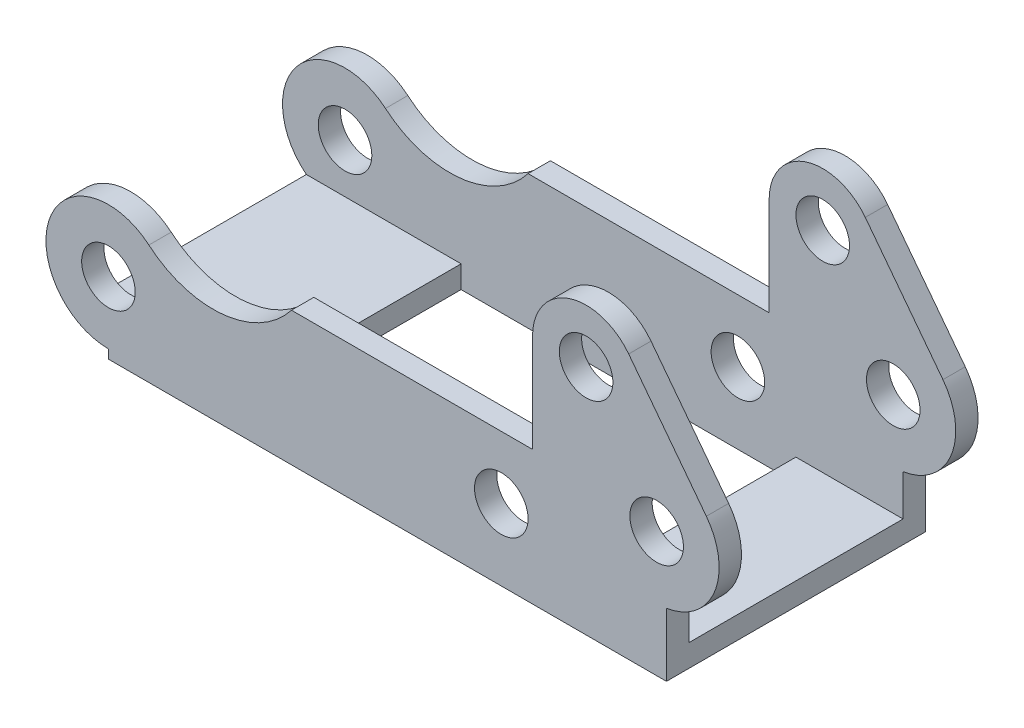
ISO-10303-21;
HEADER;
FILE_DESCRIPTION(('STEP AP214'),'2;1');
FILE_NAME('part.step','',(''),(''),'','','');
FILE_SCHEMA(('AUTOMOTIVE_DESIGN { 1 0 10303 214 1 1 1 1 }'));
ENDSEC;
DATA;
#1=APPLICATION_CONTEXT('core data for automotive mechanical design processes');
#2=APPLICATION_PROTOCOL_DEFINITION('international standard','automotive_design',2000,#1);
#3=PRODUCT_CONTEXT('',#1,'mechanical');
#4=PRODUCT('Part','Part','',(#3));
#5=PRODUCT_RELATED_PRODUCT_CATEGORY('part','',(#4));
#6=PRODUCT_DEFINITION_FORMATION('','',#4);
#7=PRODUCT_DEFINITION_CONTEXT('part definition',#1,'design');
#8=PRODUCT_DEFINITION('design','',#6,#7);
#9=PRODUCT_DEFINITION_SHAPE('','',#8);
#10=(LENGTH_UNIT() NAMED_UNIT(*) SI_UNIT(.MILLI.,.METRE.));
#11=(NAMED_UNIT(*) PLANE_ANGLE_UNIT() SI_UNIT($,.RADIAN.));
#12=(NAMED_UNIT(*) SI_UNIT($,.STERADIAN.) SOLID_ANGLE_UNIT());
#13=UNCERTAINTY_MEASURE_WITH_UNIT(LENGTH_MEASURE(1.E-05),#10,'distance_accuracy_value','');
#14=(GEOMETRIC_REPRESENTATION_CONTEXT(3) GLOBAL_UNCERTAINTY_ASSIGNED_CONTEXT((#13)) GLOBAL_UNIT_ASSIGNED_CONTEXT((#10,
#11,#12)) REPRESENTATION_CONTEXT('',''));
#15=CARTESIAN_POINT('',(0.,0.,0.));
#16=DIRECTION('',(0.,0.,1.));
#17=DIRECTION('',(1.,0.,0.));
#18=AXIS2_PLACEMENT_3D('',#15,#16,#17);
#19=CARTESIAN_POINT('',(5.85949051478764,6.90531946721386,0.));
#20=DIRECTION('',(0.,0.,1.));
#21=DIRECTION('',(1.,0.,0.));
#22=AXIS2_PLACEMENT_3D('',#19,#20,#21);
#23=CYLINDRICAL_SURFACE('',#22,5.55632740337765);
#24=DIRECTION('',(0.,0.,1.));
#25=VECTOR('',#24,1.);
#26=CARTESIAN_POINT('',(10.25,3.5,0.));
#27=LINE('',#26,#25);
#28=CARTESIAN_POINT('',(10.25,3.50000000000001,0.));
#29=VERTEX_POINT('',#28);
#30=CARTESIAN_POINT('',(10.25,3.5,1.25));
#31=VERTEX_POINT('',#30);
#32=EDGE_CURVE('E250',#29,#31,#27,.T.);
#33=ORIENTED_EDGE('',*,*,#32,.F.);
#34=CARTESIAN_POINT('',(5.85949051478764,6.90531946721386,0.));
#35=DIRECTION('',(0.,0.,1.));
#36=DIRECTION('',(1.,0.,0.));
#37=AXIS2_PLACEMENT_3D('',#34,#35,#36);
#38=CIRCLE('',#37,5.55632740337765);
#39=CARTESIAN_POINT('',(2.26451804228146,2.66869969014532,0.));
#40=VERTEX_POINT('',#39);
#41=EDGE_CURVE('E348',#29,#40,#38,.F.);
#42=ORIENTED_EDGE('',*,*,#41,.T.);
#43=DIRECTION('',(0.,0.,1.));
#44=VECTOR('',#43,1.);
#45=CARTESIAN_POINT('',(2.26451804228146,2.66869969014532,0.));
#46=LINE('',#45,#44);
#47=CARTESIAN_POINT('',(2.26451804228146,2.66869969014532,1.25));
#48=VERTEX_POINT('',#47);
#49=EDGE_CURVE('E253',#48,#40,#46,.F.);
#50=ORIENTED_EDGE('',*,*,#49,.F.);
#51=CARTESIAN_POINT('',(5.85949051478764,6.90531946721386,1.25));
#52=DIRECTION('',(0.,0.,1.));
#53=DIRECTION('',(1.,0.,0.));
#54=AXIS2_PLACEMENT_3D('',#51,#52,#53);
#55=CIRCLE('',#54,5.55632740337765);
#56=EDGE_CURVE('E334',#48,#31,#55,.T.);
#57=ORIENTED_EDGE('',*,*,#56,.T.);
#58=EDGE_LOOP('',(#33,#42,#50,#57));
#59=FACE_BOUND('',#58,.T.);
#60=ADVANCED_FACE('F15',(#59),#23,.F.);
#61=CARTESIAN_POINT('',(10.25,3.5,0.));
#62=DIRECTION('',(0.,1.,0.));
#63=DIRECTION('',(0.,0.,1.));
#64=AXIS2_PLACEMENT_3D('',#61,#62,#63);
#65=PLANE('',#64);
#66=DIRECTION('',(1.,0.,0.));
#67=VECTOR('',#66,1.);
#68=CARTESIAN_POINT('',(16.8167036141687,3.50000000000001,0.));
#69=LINE('',#68,#67);
#70=CARTESIAN_POINT('',(23.75,3.50000000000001,0.));
#71=VERTEX_POINT('',#70);
#72=EDGE_CURVE('E350',#71,#29,#69,.F.);
#73=ORIENTED_EDGE('',*,*,#72,.T.);
#74=ORIENTED_EDGE('',*,*,#32,.T.);
#75=DIRECTION('',(-1.,0.,0.));
#76=VECTOR('',#75,1.);
#77=CARTESIAN_POINT('',(-11.2965105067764,3.5,1.25));
#78=LINE('',#77,#76);
#79=CARTESIAN_POINT('',(23.75,3.5,1.25));
#80=VERTEX_POINT('',#79);
#81=EDGE_CURVE('E336',#31,#80,#78,.F.);
#82=ORIENTED_EDGE('',*,*,#81,.T.);
#83=DIRECTION('',(0.,0.,1.));
#84=VECTOR('',#83,1.);
#85=CARTESIAN_POINT('',(23.75,3.50000000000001,0.));
#86=LINE('',#85,#84);
#87=EDGE_CURVE('E247',#71,#80,#86,.T.);
#88=ORIENTED_EDGE('',*,*,#87,.F.);
#89=EDGE_LOOP('',(#73,#74,#82,#88));
#90=FACE_BOUND('',#89,.T.);
#91=ADVANCED_FACE('F515',(#90),#65,.T.);
#92=CARTESIAN_POINT('',(23.75,3.50000000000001,0.));
#93=DIRECTION('',(-1.,0.,0.));
#94=DIRECTION('',(0.,0.,1.));
#95=AXIS2_PLACEMENT_3D('',#92,#93,#94);
#96=PLANE('',#95);
#97=DIRECTION('',(0.,1.,0.));
#98=VECTOR('',#97,1.);
#99=CARTESIAN_POINT('',(23.75,1.27597686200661,0.));
#100=LINE('',#99,#98);
#101=CARTESIAN_POINT('',(23.75,9.,0.));
#102=VERTEX_POINT('',#101);
#103=EDGE_CURVE('E353',#102,#71,#100,.F.);
#104=ORIENTED_EDGE('',*,*,#103,.T.);
#105=ORIENTED_EDGE('',*,*,#87,.T.);
#106=DIRECTION('',(0.,1.,0.));
#107=VECTOR('',#106,1.);
#108=CARTESIAN_POINT('',(23.75,-2.75,1.25));
#109=LINE('',#108,#107);
#110=CARTESIAN_POINT('',(23.75,9.,1.25));
#111=VERTEX_POINT('',#110);
#112=EDGE_CURVE('E333',#80,#111,#109,.T.);
#113=ORIENTED_EDGE('',*,*,#112,.T.);
#114=DIRECTION('',(0.,0.,1.));
#115=VECTOR('',#114,1.);
#116=CARTESIAN_POINT('',(23.75,9.,0.));
#117=LINE('',#116,#115);
#118=EDGE_CURVE('E244',#102,#111,#117,.T.);
#119=ORIENTED_EDGE('',*,*,#118,.F.);
#120=EDGE_LOOP('',(#104,#105,#113,#119));
#121=FACE_BOUND('',#120,.T.);
#122=ADVANCED_FACE('F519',(#121),#96,.T.);
#123=CARTESIAN_POINT('',(26.75,9.,0.));
#124=DIRECTION('',(0.,0.,1.));
#125=DIRECTION('',(1.,0.,0.));
#126=AXIS2_PLACEMENT_3D('',#123,#124,#125);
#127=CYLINDRICAL_SURFACE('',#126,3.);
#128=CARTESIAN_POINT('',(26.75,9.,0.));
#129=DIRECTION('',(0.,0.,1.));
#130=DIRECTION('',(1.,0.,0.));
#131=AXIS2_PLACEMENT_3D('',#128,#129,#130);
#132=CIRCLE('',#131,3.);
#133=CARTESIAN_POINT('',(29.1348492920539,10.8200257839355,0.));
#134=VERTEX_POINT('',#133);
#135=EDGE_CURVE('E351',#134,#102,#132,.T.);
#136=ORIENTED_EDGE('',*,*,#135,.T.);
#137=ORIENTED_EDGE('',*,*,#118,.T.);
#138=CARTESIAN_POINT('',(26.75,9.,1.25));
#139=DIRECTION('',(0.,0.,1.));
#140=DIRECTION('',(1.,0.,0.));
#141=AXIS2_PLACEMENT_3D('',#138,#139,#140);
#142=CIRCLE('',#141,3.);
#143=CARTESIAN_POINT('',(29.1348492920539,10.8200257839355,1.25));
#144=VERTEX_POINT('',#143);
#145=EDGE_CURVE('E331',#111,#144,#142,.F.);
#146=ORIENTED_EDGE('',*,*,#145,.T.);
#147=DIRECTION('',(0.,0.,1.));
#148=VECTOR('',#147,1.);
#149=CARTESIAN_POINT('',(29.1348492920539,10.8200257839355,0.));
#150=LINE('',#149,#148);
#151=EDGE_CURVE('E179',#134,#144,#150,.T.);
#152=ORIENTED_EDGE('',*,*,#151,.F.);
#153=EDGE_LOOP('',(#136,#137,#146,#152));
#154=FACE_BOUND('',#153,.T.);
#155=ADVANCED_FACE('F521',(#154),#127,.T.);
#156=CARTESIAN_POINT('',(29.1348492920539,10.8200257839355,0.));
#157=DIRECTION('',(0.794949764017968,0.60667526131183,0.));
#158=DIRECTION('',(-0.60667526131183,0.794949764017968,0.));
#159=AXIS2_PLACEMENT_3D('',#156,#157,#158);
#160=PLANE('',#159);
#161=DIRECTION('',(-0.60667526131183,0.794949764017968,0.));
#162=VECTOR('',#161,1.);
#163=CARTESIAN_POINT('',(33.4823241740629,5.12336341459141,0.));
#164=LINE('',#163,#162);
#165=CARTESIAN_POINT('',(33.4823241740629,5.12336341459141,0.));
#166=VERTEX_POINT('',#165);
#167=EDGE_CURVE('E190',#166,#134,#164,.T.);
#168=ORIENTED_EDGE('',*,*,#167,.T.);
#169=ORIENTED_EDGE('',*,*,#151,.T.);
#170=DIRECTION('',(0.60667526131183,-0.794949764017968,0.));
#171=VECTOR('',#170,1.);
#172=CARTESIAN_POINT('',(29.1348492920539,10.8200257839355,1.25));
#173=LINE('',#172,#171);
#174=CARTESIAN_POINT('',(33.4823241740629,5.1233634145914,1.25));
#175=VERTEX_POINT('',#174);
#176=EDGE_CURVE('E330',#144,#175,#173,.T.);
#177=ORIENTED_EDGE('',*,*,#176,.T.);
#178=DIRECTION('',(0.,0.,1.));
#179=VECTOR('',#178,1.);
#180=CARTESIAN_POINT('',(33.4823241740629,5.1233634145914,0.));
#181=LINE('',#180,#179);
#182=EDGE_CURVE('E178',#166,#175,#181,.T.);
#183=ORIENTED_EDGE('',*,*,#182,.F.);
#184=EDGE_LOOP('',(#168,#169,#177,#183));
#185=FACE_BOUND('',#184,.T.);
#186=ADVANCED_FACE('F523',(#185),#160,.T.);
#187=CARTESIAN_POINT('',(30.7,3.,0.));
#188=DIRECTION('',(0.,0.,1.));
#189=DIRECTION('',(1.,0.,0.));
#190=AXIS2_PLACEMENT_3D('',#187,#188,#189);
#191=CYLINDRICAL_SURFACE('',#190,3.5);
#192=CARTESIAN_POINT('',(30.7,3.,0.));
#193=DIRECTION('',(0.,0.,1.));
#194=DIRECTION('',(1.,0.,0.));
#195=AXIS2_PLACEMENT_3D('',#192,#193,#194);
#196=CIRCLE('',#195,3.5);
#197=CARTESIAN_POINT('',(31.25,-0.456515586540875,0.));
#198=VERTEX_POINT('',#197);
#199=EDGE_CURVE('E18',#198,#166,#196,.T.);
#200=ORIENTED_EDGE('',*,*,#199,.T.);
#201=ORIENTED_EDGE('',*,*,#182,.T.);
#202=CARTESIAN_POINT('',(30.7,3.,1.25));
#203=DIRECTION('',(0.,0.,1.));
#204=DIRECTION('',(1.,0.,0.));
#205=AXIS2_PLACEMENT_3D('',#202,#203,#204);
#206=CIRCLE('',#205,3.5);
#207=CARTESIAN_POINT('',(31.25,-0.456515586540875,1.25));
#208=VERTEX_POINT('',#207);
#209=EDGE_CURVE('E173',#175,#208,#206,.F.);
#210=ORIENTED_EDGE('',*,*,#209,.T.);
#211=DIRECTION('',(0.,0.,1.));
#212=VECTOR('',#211,1.);
#213=CARTESIAN_POINT('',(31.25,-0.456515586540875,0.));
#214=LINE('',#213,#212);
#215=EDGE_CURVE('E167',#208,#198,#214,.F.);
#216=ORIENTED_EDGE('',*,*,#215,.T.);
#217=EDGE_LOOP('',(#200,#201,#210,#216));
#218=FACE_BOUND('',#217,.T.);
#219=ADVANCED_FACE('F169',(#218),#191,.T.);
#220=CARTESIAN_POINT('',(26.75,9.,0.));
#221=DIRECTION('',(0.,0.,1.));
#222=DIRECTION('',(1.,0.,0.));
#223=AXIS2_PLACEMENT_3D('',#220,#221,#222);
#224=CYLINDRICAL_SURFACE('',#223,1.5);
#225=CARTESIAN_POINT('',(26.75,9.,1.25));
#226=DIRECTION('',(0.,0.,1.));
#227=DIRECTION('',(1.,0.,0.));
#228=AXIS2_PLACEMENT_3D('',#225,#226,#227);
#229=CIRCLE('',#228,1.5);
#230=CARTESIAN_POINT('',(28.25,9.,1.25));
#231=VERTEX_POINT('',#230);
#232=EDGE_CURVE('E326',#231,#231,#229,.T.);
#233=ORIENTED_EDGE('',*,*,#232,.T.);
#234=EDGE_LOOP('',(#233));
#235=FACE_BOUND('',#234,.T.);
#236=CARTESIAN_POINT('',(26.75,9.,0.));
#237=DIRECTION('',(0.,0.,1.));
#238=DIRECTION('',(1.,0.,0.));
#239=AXIS2_PLACEMENT_3D('',#236,#237,#238);
#240=CIRCLE('',#239,1.5);
#241=CARTESIAN_POINT('',(28.25,9.,0.));
#242=VERTEX_POINT('',#241);
#243=EDGE_CURVE('E345',#242,#242,#240,.F.);
#244=ORIENTED_EDGE('',*,*,#243,.T.);
#245=EDGE_LOOP('',(#244));
#246=FACE_BOUND('',#245,.T.);
#247=ADVANCED_FACE('F530',(#235,#246),#224,.F.);
#248=CARTESIAN_POINT('',(30.7,3.,0.));
#249=DIRECTION('',(0.,0.,1.));
#250=DIRECTION('',(1.,0.,0.));
#251=AXIS2_PLACEMENT_3D('',#248,#249,#250);
#252=CYLINDRICAL_SURFACE('',#251,1.5);
#253=CARTESIAN_POINT('',(30.7,3.,1.25));
#254=DIRECTION('',(0.,0.,1.));
#255=DIRECTION('',(1.,0.,0.));
#256=AXIS2_PLACEMENT_3D('',#253,#254,#255);
#257=CIRCLE('',#256,1.5);
#258=CARTESIAN_POINT('',(32.2,3.,1.25));
#259=VERTEX_POINT('',#258);
#260=EDGE_CURVE('E323',#259,#259,#257,.T.);
#261=ORIENTED_EDGE('',*,*,#260,.T.);
#262=EDGE_LOOP('',(#261));
#263=FACE_BOUND('',#262,.T.);
#264=CARTESIAN_POINT('',(30.7,3.,0.));
#265=DIRECTION('',(0.,0.,1.));
#266=DIRECTION('',(1.,0.,0.));
#267=AXIS2_PLACEMENT_3D('',#264,#265,#266);
#268=CIRCLE('',#267,1.5);
#269=CARTESIAN_POINT('',(32.2,3.,0.));
#270=VERTEX_POINT('',#269);
#271=EDGE_CURVE('E342',#270,#270,#268,.F.);
#272=ORIENTED_EDGE('',*,*,#271,.T.);
#273=EDGE_LOOP('',(#272));
#274=FACE_BOUND('',#273,.T.);
#275=ADVANCED_FACE('F570',(#263,#274),#252,.F.);
#276=CARTESIAN_POINT('',(22.,0.,0.));
#277=DIRECTION('',(0.,0.,1.));
#278=DIRECTION('',(1.,0.,0.));
#279=AXIS2_PLACEMENT_3D('',#276,#277,#278);
#280=CYLINDRICAL_SURFACE('',#279,1.5);
#281=CARTESIAN_POINT('',(22.,0.,1.25));
#282=DIRECTION('',(0.,0.,1.));
#283=DIRECTION('',(1.,0.,0.));
#284=AXIS2_PLACEMENT_3D('',#281,#282,#283);
#285=CIRCLE('',#284,1.5);
#286=CARTESIAN_POINT('',(23.5,0.,1.25));
#287=VERTEX_POINT('',#286);
#288=EDGE_CURVE('E320',#287,#287,#285,.T.);
#289=ORIENTED_EDGE('',*,*,#288,.T.);
#290=EDGE_LOOP('',(#289));
#291=FACE_BOUND('',#290,.T.);
#292=CARTESIAN_POINT('',(22.,0.,0.));
#293=DIRECTION('',(0.,0.,1.));
#294=DIRECTION('',(1.,0.,0.));
#295=AXIS2_PLACEMENT_3D('',#292,#293,#294);
#296=CIRCLE('',#295,1.5);
#297=CARTESIAN_POINT('',(23.5,0.,0.));
#298=VERTEX_POINT('',#297);
#299=EDGE_CURVE('E339',#298,#298,#296,.F.);
#300=ORIENTED_EDGE('',*,*,#299,.T.);
#301=EDGE_LOOP('',(#300));
#302=FACE_BOUND('',#301,.T.);
#303=ADVANCED_FACE('F577',(#291,#302),#280,.F.);
#304=CARTESIAN_POINT('',(0.,0.,0.));
#305=DIRECTION('',(0.,0.,1.));
#306=DIRECTION('',(1.,0.,0.));
#307=AXIS2_PLACEMENT_3D('',#304,#305,#306);
#308=CYLINDRICAL_SURFACE('',#307,1.5);
#309=CARTESIAN_POINT('',(0.,0.,1.25));
#310=DIRECTION('',(0.,0.,1.));
#311=DIRECTION('',(1.,0.,0.));
#312=AXIS2_PLACEMENT_3D('',#309,#310,#311);
#313=CIRCLE('',#312,1.5);
#314=CARTESIAN_POINT('',(1.5,0.,1.25));
#315=VERTEX_POINT('',#314);
#316=EDGE_CURVE('E224',#315,#315,#313,.T.);
#317=ORIENTED_EDGE('',*,*,#316,.T.);
#318=EDGE_LOOP('',(#317));
#319=FACE_BOUND('',#318,.T.);
#320=CARTESIAN_POINT('',(0.,0.,0.));
#321=DIRECTION('',(0.,0.,1.));
#322=DIRECTION('',(1.,0.,0.));
#323=AXIS2_PLACEMENT_3D('',#320,#321,#322);
#324=CIRCLE('',#323,1.5);
#325=CARTESIAN_POINT('',(1.5,0.,0.));
#326=VERTEX_POINT('',#325);
#327=EDGE_CURVE('E240',#326,#326,#324,.F.);
#328=ORIENTED_EDGE('',*,*,#327,.T.);
#329=EDGE_LOOP('',(#328));
#330=FACE_BOUND('',#329,.T.);
#331=ADVANCED_FACE('F585',(#319,#330),#308,.F.);
#332=CARTESIAN_POINT('',(15.774989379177,-2.75,7.25));
#333=DIRECTION('',(0.,1.,0.));
#334=DIRECTION('',(0.,0.,1.));
#335=AXIS2_PLACEMENT_3D('',#332,#333,#334);
#336=PLANE('',#335);
#337=DIRECTION('',(0.,0.,1.));
#338=VECTOR('',#337,1.);
#339=CARTESIAN_POINT('',(-2.1650635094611,-2.75,0.));
#340=LINE('',#339,#338);
#341=CARTESIAN_POINT('',(-2.1650635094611,-2.75,13.25));
#342=VERTEX_POINT('',#341);
#343=CARTESIAN_POINT('',(-2.1650635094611,-2.75,1.25));
#344=VERTEX_POINT('',#343);
#345=EDGE_CURVE('E215',#342,#344,#340,.F.);
#346=ORIENTED_EDGE('',*,*,#345,.F.);
#347=DIRECTION('',(1.,0.,0.));
#348=VECTOR('',#347,1.);
#349=CARTESIAN_POINT('',(42.8464892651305,-2.75,13.25));
#350=LINE('',#349,#348);
#351=CARTESIAN_POINT('',(6.5,-2.75,13.25));
#352=VERTEX_POINT('',#351);
#353=EDGE_CURVE('E236',#342,#352,#350,.T.);
#354=ORIENTED_EDGE('',*,*,#353,.T.);
#355=DIRECTION('',(0.,0.,1.));
#356=VECTOR('',#355,1.);
#357=CARTESIAN_POINT('',(6.5,-2.75,1.25));
#358=LINE('',#357,#356);
#359=CARTESIAN_POINT('',(6.5,-2.75,1.25));
#360=VERTEX_POINT('',#359);
#361=EDGE_CURVE('E214',#352,#360,#358,.F.);
#362=ORIENTED_EDGE('',*,*,#361,.T.);
#363=DIRECTION('',(-1.,0.,0.));
#364=VECTOR('',#363,1.);
#365=CARTESIAN_POINT('',(-11.2965105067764,-2.75,1.25));
#366=LINE('',#365,#364);
#367=EDGE_CURVE('E257',#360,#344,#366,.T.);
#368=ORIENTED_EDGE('',*,*,#367,.T.);
#369=EDGE_LOOP('',(#346,#354,#362,#368));
#370=FACE_BOUND('',#369,.T.);
#371=ADVANCED_FACE('F508',(#370),#336,.T.);
#372=CARTESIAN_POINT('',(0.,-4.,0.));
#373=DIRECTION('',(-1.,0.,0.));
#374=DIRECTION('',(0.,0.,1.));
#375=AXIS2_PLACEMENT_3D('',#372,#373,#374);
#376=PLANE('',#375);
#377=DIRECTION('',(0.,1.,0.));
#378=VECTOR('',#377,1.);
#379=CARTESIAN_POINT('',(0.,1.27597686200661,0.));
#380=LINE('',#379,#378);
#381=CARTESIAN_POINT('',(0.,-3.5,0.));
#382=VERTEX_POINT('',#381);
#383=CARTESIAN_POINT('',(0.,-3.99999999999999,0.));
#384=VERTEX_POINT('',#383);
#385=EDGE_CURVE('E191',#382,#384,#380,.F.);
#386=ORIENTED_EDGE('',*,*,#385,.T.);
#387=DIRECTION('',(0.,0.,-1.));
#388=VECTOR('',#387,1.);
#389=CARTESIAN_POINT('',(0.,-3.99999999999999,0.));
#390=LINE('',#389,#388);
#391=CARTESIAN_POINT('',(0.,-4.,14.5));
#392=VERTEX_POINT('',#391);
#393=EDGE_CURVE('E207',#392,#384,#390,.T.);
#394=ORIENTED_EDGE('',*,*,#393,.F.);
#395=DIRECTION('',(0.,1.,0.));
#396=VECTOR('',#395,1.);
#397=CARTESIAN_POINT('',(0.,-4.,14.5));
#398=LINE('',#397,#396);
#399=CARTESIAN_POINT('',(0.,-3.5,14.5));
#400=VERTEX_POINT('',#399);
#401=EDGE_CURVE('E212',#392,#400,#398,.T.);
#402=ORIENTED_EDGE('',*,*,#401,.T.);
#403=DIRECTION('',(0.,0.,1.));
#404=VECTOR('',#403,1.);
#405=CARTESIAN_POINT('',(0.,-3.5,0.));
#406=LINE('',#405,#404);
#407=EDGE_CURVE('E312',#382,#400,#406,.T.);
#408=ORIENTED_EDGE('',*,*,#407,.F.);
#409=EDGE_LOOP('',(#386,#394,#402,#408));
#410=FACE_BOUND('',#409,.T.);
#411=ADVANCED_FACE('F426',(#410),#376,.T.);
#412=CARTESIAN_POINT('',(25.25,-2.74999999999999,13.25));
#413=DIRECTION('',(1.,0.,0.));
#414=DIRECTION('',(0.,0.,-1.));
#415=AXIS2_PLACEMENT_3D('',#412,#413,#414);
#416=PLANE('',#415);
#417=DIRECTION('',(0.,1.,0.));
#418=VECTOR('',#417,1.);
#419=CARTESIAN_POINT('',(25.25,-2.74999999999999,13.25));
#420=LINE('',#419,#418);
#421=CARTESIAN_POINT('',(25.25,-3.99999999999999,13.25));
#422=VERTEX_POINT('',#421);
#423=CARTESIAN_POINT('',(25.25,-2.74999999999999,13.25));
#424=VERTEX_POINT('',#423);
#425=EDGE_CURVE('E211',#422,#424,#420,.T.);
#426=ORIENTED_EDGE('',*,*,#425,.T.);
#427=DIRECTION('',(0.,0.,1.));
#428=VECTOR('',#427,1.);
#429=CARTESIAN_POINT('',(25.25,-2.75,7.25));
#430=LINE('',#429,#428);
#431=CARTESIAN_POINT('',(25.25,-2.75,1.25));
#432=VERTEX_POINT('',#431);
#433=EDGE_CURVE('E220',#432,#424,#430,.T.);
#434=ORIENTED_EDGE('',*,*,#433,.F.);
#435=DIRECTION('',(0.,1.,0.));
#436=VECTOR('',#435,1.);
#437=CARTESIAN_POINT('',(25.25,-2.75,1.25));
#438=LINE('',#437,#436);
#439=CARTESIAN_POINT('',(25.25,-3.99999999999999,1.25));
#440=VERTEX_POINT('',#439);
#441=EDGE_CURVE('E237',#432,#440,#438,.F.);
#442=ORIENTED_EDGE('',*,*,#441,.T.);
#443=DIRECTION('',(0.,0.,-1.));
#444=VECTOR('',#443,1.);
#445=CARTESIAN_POINT('',(25.25,-3.99999999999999,0.));
#446=LINE('',#445,#444);
#447=EDGE_CURVE('E227',#422,#440,#446,.T.);
#448=ORIENTED_EDGE('',*,*,#447,.F.);
#449=EDGE_LOOP('',(#426,#434,#442,#448));
#450=FACE_BOUND('',#449,.T.);
#451=ADVANCED_FACE('F495',(#450),#416,.F.);
#452=CARTESIAN_POINT('',(6.5,-2.75,1.25));
#453=DIRECTION('',(-1.,0.,0.));
#454=DIRECTION('',(0.,0.,1.));
#455=AXIS2_PLACEMENT_3D('',#452,#453,#454);
#456=PLANE('',#455);
#457=DIRECTION('',(0.,1.,0.));
#458=VECTOR('',#457,1.);
#459=CARTESIAN_POINT('',(6.5,-2.75,1.25));
#460=LINE('',#459,#458);
#461=CARTESIAN_POINT('',(6.5,-3.99999999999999,1.25));
#462=VERTEX_POINT('',#461);
#463=EDGE_CURVE('E239',#462,#360,#460,.T.);
#464=ORIENTED_EDGE('',*,*,#463,.T.);
#465=ORIENTED_EDGE('',*,*,#361,.F.);
#466=DIRECTION('',(0.,1.,0.));
#467=VECTOR('',#466,1.);
#468=CARTESIAN_POINT('',(6.5,-2.74999999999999,13.25));
#469=LINE('',#468,#467);
#470=CARTESIAN_POINT('',(6.5,-4.,13.25));
#471=VERTEX_POINT('',#470);
#472=EDGE_CURVE('E226',#352,#471,#469,.F.);
#473=ORIENTED_EDGE('',*,*,#472,.T.);
#474=DIRECTION('',(0.,0.,-1.));
#475=VECTOR('',#474,1.);
#476=CARTESIAN_POINT('',(6.5,-3.99999999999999,0.));
#477=LINE('',#476,#475);
#478=EDGE_CURVE('E258',#462,#471,#477,.F.);
#479=ORIENTED_EDGE('',*,*,#478,.F.);
#480=EDGE_LOOP('',(#464,#465,#473,#479));
#481=FACE_BOUND('',#480,.T.);
#482=ADVANCED_FACE('F505',(#481),#456,.F.);
#483=CARTESIAN_POINT('',(16.8167036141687,1.27597686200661,0.));
#484=DIRECTION('',(0.,0.,1.));
#485=DIRECTION('',(1.,0.,0.));
#486=AXIS2_PLACEMENT_3D('',#483,#484,#485);
#487=PLANE('',#486);
#488=ORIENTED_EDGE('',*,*,#327,.F.);
#489=EDGE_LOOP('',(#488));
#490=FACE_BOUND('',#489,.T.);
#491=ORIENTED_EDGE('',*,*,#299,.F.);
#492=EDGE_LOOP('',(#491));
#493=FACE_BOUND('',#492,.T.);
#494=ORIENTED_EDGE('',*,*,#271,.F.);
#495=EDGE_LOOP('',(#494));
#496=FACE_BOUND('',#495,.T.);
#497=ORIENTED_EDGE('',*,*,#243,.F.);
#498=EDGE_LOOP('',(#497));
#499=FACE_BOUND('',#498,.T.);
#500=ORIENTED_EDGE('',*,*,#41,.F.);
#501=ORIENTED_EDGE('',*,*,#72,.F.);
#502=ORIENTED_EDGE('',*,*,#103,.F.);
#503=ORIENTED_EDGE('',*,*,#135,.F.);
#504=ORIENTED_EDGE('',*,*,#167,.F.);
#505=ORIENTED_EDGE('',*,*,#199,.F.);
#506=DIRECTION('',(0.,1.,0.));
#507=VECTOR('',#506,1.);
#508=CARTESIAN_POINT('',(31.25,-0.456515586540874,0.));
#509=LINE('',#508,#507);
#510=CARTESIAN_POINT('',(31.25,-3.99999999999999,0.));
#511=VERTEX_POINT('',#510);
#512=EDGE_CURVE('E186',#511,#198,#509,.T.);
#513=ORIENTED_EDGE('',*,*,#512,.F.);
#514=DIRECTION('',(1.,0.,0.));
#515=VECTOR('',#514,1.);
#516=CARTESIAN_POINT('',(31.25,-3.99999999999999,0.));
#517=LINE('',#516,#515);
#518=EDGE_CURVE('E204',#384,#511,#517,.T.);
#519=ORIENTED_EDGE('',*,*,#518,.F.);
#520=ORIENTED_EDGE('',*,*,#385,.F.);
#521=CARTESIAN_POINT('',(0.,0.,0.));
#522=DIRECTION('',(0.,0.,1.));
#523=DIRECTION('',(1.,0.,0.));
#524=AXIS2_PLACEMENT_3D('',#521,#522,#523);
#525=CIRCLE('',#524,3.5);
#526=EDGE_CURVE('E309',#40,#382,#525,.T.);
#527=ORIENTED_EDGE('',*,*,#526,.F.);
#528=EDGE_LOOP('',(#500,#501,#502,#503,#504,#505,#513,#519,#520,#527));
#529=FACE_BOUND('',#528,.T.);
#530=ADVANCED_FACE('F184',(#490,#493,#496,#499,#529),#487,.F.);
#531=CARTESIAN_POINT('',(-11.2965105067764,-2.75,1.25));
#532=DIRECTION('',(0.,0.,-1.));
#533=DIRECTION('',(-1.,0.,0.));
#534=AXIS2_PLACEMENT_3D('',#531,#532,#533);
#535=PLANE('',#534);
#536=ORIENTED_EDGE('',*,*,#316,.F.);
#537=EDGE_LOOP('',(#536));
#538=FACE_BOUND('',#537,.T.);
#539=ORIENTED_EDGE('',*,*,#288,.F.);
#540=EDGE_LOOP('',(#539));
#541=FACE_BOUND('',#540,.T.);
#542=ORIENTED_EDGE('',*,*,#260,.F.);
#543=EDGE_LOOP('',(#542));
#544=FACE_BOUND('',#543,.T.);
#545=ORIENTED_EDGE('',*,*,#232,.F.);
#546=EDGE_LOOP('',(#545));
#547=FACE_BOUND('',#546,.T.);
#548=ORIENTED_EDGE('',*,*,#209,.F.);
#549=ORIENTED_EDGE('',*,*,#176,.F.);
#550=ORIENTED_EDGE('',*,*,#145,.F.);
#551=ORIENTED_EDGE('',*,*,#112,.F.);
#552=ORIENTED_EDGE('',*,*,#81,.F.);
#553=ORIENTED_EDGE('',*,*,#56,.F.);
#554=CARTESIAN_POINT('',(0.,0.,1.25));
#555=DIRECTION('',(0.,0.,1.));
#556=DIRECTION('',(1.,0.,0.));
#557=AXIS2_PLACEMENT_3D('',#554,#555,#556);
#558=CIRCLE('',#557,3.5);
#559=EDGE_CURVE('E218',#344,#48,#558,.F.);
#560=ORIENTED_EDGE('',*,*,#559,.F.);
#561=ORIENTED_EDGE('',*,*,#367,.F.);
#562=ORIENTED_EDGE('',*,*,#463,.F.);
#563=DIRECTION('',(1.,0.,0.));
#564=VECTOR('',#563,1.);
#565=CARTESIAN_POINT('',(31.25,-3.99999999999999,1.25));
#566=LINE('',#565,#564);
#567=EDGE_CURVE('E230',#440,#462,#566,.F.);
#568=ORIENTED_EDGE('',*,*,#567,.F.);
#569=ORIENTED_EDGE('',*,*,#441,.F.);
#570=DIRECTION('',(1.,0.,0.));
#571=VECTOR('',#570,1.);
#572=CARTESIAN_POINT('',(15.774989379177,-2.75,1.25));
#573=LINE('',#572,#571);
#574=CARTESIAN_POINT('',(31.25,-2.74999999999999,1.25));
#575=VERTEX_POINT('',#574);
#576=EDGE_CURVE('E223',#575,#432,#573,.F.);
#577=ORIENTED_EDGE('',*,*,#576,.F.);
#578=DIRECTION('',(0.,1.,0.));
#579=VECTOR('',#578,1.);
#580=CARTESIAN_POINT('',(31.25,-0.456515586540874,1.25));
#581=LINE('',#580,#579);
#582=EDGE_CURVE('E195',#208,#575,#581,.F.);
#583=ORIENTED_EDGE('',*,*,#582,.F.);
#584=EDGE_LOOP('',(#548,#549,#550,#551,#552,#553,#560,#561,#562,#568,#569,#577,#583));
#585=FACE_BOUND('',#584,.T.);
#586=ADVANCED_FACE('F498',(#538,#541,#544,#547,#585),#535,.F.);
#587=CARTESIAN_POINT('',(15.774989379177,-2.75,7.25));
#588=DIRECTION('',(0.,1.,0.));
#589=DIRECTION('',(0.,0.,1.));
#590=AXIS2_PLACEMENT_3D('',#587,#588,#589);
#591=PLANE('',#590);
#592=DIRECTION('',(0.,0.,-1.));
#593=VECTOR('',#592,1.);
#594=CARTESIAN_POINT('',(31.25,-2.74999999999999,0.));
#595=LINE('',#594,#593);
#596=CARTESIAN_POINT('',(31.25,-2.74999999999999,13.25));
#597=VERTEX_POINT('',#596);
#598=EDGE_CURVE('E197',#575,#597,#595,.F.);
#599=ORIENTED_EDGE('',*,*,#598,.F.);
#600=ORIENTED_EDGE('',*,*,#576,.T.);
#601=ORIENTED_EDGE('',*,*,#433,.T.);
#602=DIRECTION('',(1.,0.,0.));
#603=VECTOR('',#602,1.);
#604=CARTESIAN_POINT('',(42.8464892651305,-2.74999999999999,13.25));
#605=LINE('',#604,#603);
#606=EDGE_CURVE('E208',#424,#597,#605,.T.);
#607=ORIENTED_EDGE('',*,*,#606,.T.);
#608=EDGE_LOOP('',(#599,#600,#601,#607));
#609=FACE_BOUND('',#608,.T.);
#610=ADVANCED_FACE('F479',(#609),#591,.T.);
#611=CARTESIAN_POINT('',(42.8464892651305,-2.74999999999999,13.25));
#612=DIRECTION('',(0.,0.,1.));
#613=DIRECTION('',(1.,0.,0.));
#614=AXIS2_PLACEMENT_3D('',#611,#612,#613);
#615=PLANE('',#614);
#616=CARTESIAN_POINT('',(26.75,9.,13.25));
#617=DIRECTION('',(0.,0.,1.));
#618=DIRECTION('',(1.,0.,0.));
#619=AXIS2_PLACEMENT_3D('',#616,#617,#618);
#620=CIRCLE('',#619,1.5);
#621=CARTESIAN_POINT('',(28.25,9.,13.25));
#622=VERTEX_POINT('',#621);
#623=EDGE_CURVE('E297',#622,#622,#620,.T.);
#624=ORIENTED_EDGE('',*,*,#623,.T.);
#625=EDGE_LOOP('',(#624));
#626=FACE_BOUND('',#625,.T.);
#627=CARTESIAN_POINT('',(30.7,3.,13.25));
#628=DIRECTION('',(0.,0.,1.));
#629=DIRECTION('',(1.,0.,0.));
#630=AXIS2_PLACEMENT_3D('',#627,#628,#629);
#631=CIRCLE('',#630,1.5);
#632=CARTESIAN_POINT('',(32.2,3.,13.25));
#633=VERTEX_POINT('',#632);
#634=EDGE_CURVE('E294',#633,#633,#631,.T.);
#635=ORIENTED_EDGE('',*,*,#634,.T.);
#636=EDGE_LOOP('',(#635));
#637=FACE_BOUND('',#636,.T.);
#638=CARTESIAN_POINT('',(22.,0.,13.25));
#639=DIRECTION('',(0.,0.,1.));
#640=DIRECTION('',(1.,0.,0.));
#641=AXIS2_PLACEMENT_3D('',#638,#639,#640);
#642=CIRCLE('',#641,1.5);
#643=CARTESIAN_POINT('',(23.5,0.,13.25));
#644=VERTEX_POINT('',#643);
#645=EDGE_CURVE('E291',#644,#644,#642,.T.);
#646=ORIENTED_EDGE('',*,*,#645,.T.);
#647=EDGE_LOOP('',(#646));
#648=FACE_BOUND('',#647,.T.);
#649=CARTESIAN_POINT('',(0.,0.,13.25));
#650=DIRECTION('',(0.,0.,1.));
#651=DIRECTION('',(1.,0.,0.));
#652=AXIS2_PLACEMENT_3D('',#649,#650,#651);
#653=CIRCLE('',#652,1.5);
#654=CARTESIAN_POINT('',(1.5,0.,13.25));
#655=VERTEX_POINT('',#654);
#656=EDGE_CURVE('E288',#655,#655,#653,.T.);
#657=ORIENTED_EDGE('',*,*,#656,.T.);
#658=EDGE_LOOP('',(#657));
#659=FACE_BOUND('',#658,.T.);
#660=ORIENTED_EDGE('',*,*,#606,.F.);
#661=ORIENTED_EDGE('',*,*,#425,.F.);
#662=DIRECTION('',(1.,0.,0.));
#663=VECTOR('',#662,1.);
#664=CARTESIAN_POINT('',(31.25,-3.99999999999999,13.25));
#665=LINE('',#664,#663);
#666=EDGE_CURVE('E206',#471,#422,#665,.T.);
#667=ORIENTED_EDGE('',*,*,#666,.F.);
#668=ORIENTED_EDGE('',*,*,#472,.F.);
#669=ORIENTED_EDGE('',*,*,#353,.F.);
#670=CARTESIAN_POINT('',(0.,0.,13.25));
#671=DIRECTION('',(0.,0.,1.));
#672=DIRECTION('',(1.,0.,0.));
#673=AXIS2_PLACEMENT_3D('',#670,#671,#672);
#674=CIRCLE('',#673,3.5);
#675=CARTESIAN_POINT('',(2.26451804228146,2.66869969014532,13.25));
#676=VERTEX_POINT('',#675);
#677=EDGE_CURVE('E219',#676,#342,#674,.T.);
#678=ORIENTED_EDGE('',*,*,#677,.F.);
#679=CARTESIAN_POINT('',(5.85949051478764,6.90531946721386,13.25));
#680=DIRECTION('',(0.,0.,1.));
#681=DIRECTION('',(1.,0.,0.));
#682=AXIS2_PLACEMENT_3D('',#679,#680,#681);
#683=CIRCLE('',#682,5.55632740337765);
#684=CARTESIAN_POINT('',(10.25,3.5,13.25));
#685=VERTEX_POINT('',#684);
#686=EDGE_CURVE('E210',#676,#685,#683,.T.);
#687=ORIENTED_EDGE('',*,*,#686,.T.);
#688=DIRECTION('',(1.,0.,0.));
#689=VECTOR('',#688,1.);
#690=CARTESIAN_POINT('',(10.25,3.5,13.25));
#691=LINE('',#690,#689);
#692=CARTESIAN_POINT('',(23.75,3.5,13.25));
#693=VERTEX_POINT('',#692);
#694=EDGE_CURVE('E376',#693,#685,#691,.F.);
#695=ORIENTED_EDGE('',*,*,#694,.F.);
#696=DIRECTION('',(0.,1.,0.));
#697=VECTOR('',#696,1.);
#698=CARTESIAN_POINT('',(23.75,3.50000000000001,13.25));
#699=LINE('',#698,#697);
#700=CARTESIAN_POINT('',(23.75,9.,13.25));
#701=VERTEX_POINT('',#700);
#702=EDGE_CURVE('E381',#701,#693,#699,.F.);
#703=ORIENTED_EDGE('',*,*,#702,.F.);
#704=CARTESIAN_POINT('',(26.75,9.,13.25));
#705=DIRECTION('',(0.,0.,1.));
#706=DIRECTION('',(1.,0.,0.));
#707=AXIS2_PLACEMENT_3D('',#704,#705,#706);
#708=CIRCLE('',#707,3.);
#709=CARTESIAN_POINT('',(29.1348492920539,10.8200257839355,13.25));
#710=VERTEX_POINT('',#709);
#711=EDGE_CURVE('E300',#710,#701,#708,.T.);
#712=ORIENTED_EDGE('',*,*,#711,.F.);
#713=DIRECTION('',(-0.60667526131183,0.794949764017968,0.));
#714=VECTOR('',#713,1.);
#715=CARTESIAN_POINT('',(29.1348492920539,10.8200257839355,13.25));
#716=LINE('',#715,#714);
#717=CARTESIAN_POINT('',(33.4823241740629,5.12336341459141,13.25));
#718=VERTEX_POINT('',#717);
#719=EDGE_CURVE('E373',#718,#710,#716,.T.);
#720=ORIENTED_EDGE('',*,*,#719,.F.);
#721=CARTESIAN_POINT('',(30.7,3.,13.25));
#722=DIRECTION('',(0.,0.,1.));
#723=DIRECTION('',(1.,0.,0.));
#724=AXIS2_PLACEMENT_3D('',#721,#722,#723);
#725=CIRCLE('',#724,3.5);
#726=CARTESIAN_POINT('',(31.25,-0.456515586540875,13.25));
#727=VERTEX_POINT('',#726);
#728=EDGE_CURVE('E305',#727,#718,#725,.T.);
#729=ORIENTED_EDGE('',*,*,#728,.F.);
#730=DIRECTION('',(0.,1.,0.));
#731=VECTOR('',#730,1.);
#732=CARTESIAN_POINT('',(31.25,-0.456515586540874,13.25));
#733=LINE('',#732,#731);
#734=EDGE_CURVE('E199',#597,#727,#733,.T.);
#735=ORIENTED_EDGE('',*,*,#734,.F.);
#736=EDGE_LOOP('',(#660,#661,#667,#668,#669,#678,#687,#695,#703,#712,#720,#729,#735));
#737=FACE_BOUND('',#736,.T.);
#738=ADVANCED_FACE('F476',(#626,#637,#648,#659,#737),#615,.F.);
#739=CARTESIAN_POINT('',(5.85949051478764,6.90531946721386,0.));
#740=DIRECTION('',(0.,0.,1.));
#741=DIRECTION('',(1.,0.,0.));
#742=AXIS2_PLACEMENT_3D('',#739,#740,#741);
#743=CYLINDRICAL_SURFACE('',#742,5.55632740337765);
#744=DIRECTION('',(0.,0.,1.));
#745=VECTOR('',#744,1.);
#746=CARTESIAN_POINT('',(2.26451804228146,2.66869969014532,0.));
#747=LINE('',#746,#745);
#748=CARTESIAN_POINT('',(2.26451804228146,2.66869969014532,14.5));
#749=VERTEX_POINT('',#748);
#750=EDGE_CURVE('E384',#749,#676,#747,.F.);
#751=ORIENTED_EDGE('',*,*,#750,.F.);
#752=CARTESIAN_POINT('',(5.85949051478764,6.90531946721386,14.5));
#753=DIRECTION('',(0.,0.,1.));
#754=DIRECTION('',(1.,0.,0.));
#755=AXIS2_PLACEMENT_3D('',#752,#753,#754);
#756=CIRCLE('',#755,5.55632740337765);
#757=CARTESIAN_POINT('',(10.25,3.50000000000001,14.5));
#758=VERTEX_POINT('',#757);
#759=EDGE_CURVE('E285',#758,#749,#756,.F.);
#760=ORIENTED_EDGE('',*,*,#759,.F.);
#761=DIRECTION('',(0.,0.,1.));
#762=VECTOR('',#761,1.);
#763=CARTESIAN_POINT('',(10.25,3.5,0.));
#764=LINE('',#763,#762);
#765=EDGE_CURVE('E379',#685,#758,#764,.T.);
#766=ORIENTED_EDGE('',*,*,#765,.F.);
#767=ORIENTED_EDGE('',*,*,#686,.F.);
#768=EDGE_LOOP('',(#751,#760,#766,#767));
#769=FACE_BOUND('',#768,.T.);
#770=ADVANCED_FACE('F418',(#769),#743,.F.);
#771=CARTESIAN_POINT('',(0.,0.,0.));
#772=DIRECTION('',(0.,0.,1.));
#773=DIRECTION('',(1.,0.,0.));
#774=AXIS2_PLACEMENT_3D('',#771,#772,#773);
#775=CYLINDRICAL_SURFACE('',#774,3.5);
#776=CARTESIAN_POINT('',(0.,0.,14.5));
#777=DIRECTION('',(0.,0.,1.));
#778=DIRECTION('',(1.,0.,0.));
#779=AXIS2_PLACEMENT_3D('',#776,#777,#778);
#780=CIRCLE('',#779,3.5);
#781=EDGE_CURVE('E281',#749,#400,#780,.T.);
#782=ORIENTED_EDGE('',*,*,#781,.F.);
#783=ORIENTED_EDGE('',*,*,#750,.T.);
#784=ORIENTED_EDGE('',*,*,#677,.T.);
#785=ORIENTED_EDGE('',*,*,#345,.T.);
#786=ORIENTED_EDGE('',*,*,#559,.T.);
#787=ORIENTED_EDGE('',*,*,#49,.T.);
#788=ORIENTED_EDGE('',*,*,#526,.T.);
#789=ORIENTED_EDGE('',*,*,#407,.T.);
#790=EDGE_LOOP('',(#782,#783,#784,#785,#786,#787,#788,#789));
#791=FACE_BOUND('',#790,.T.);
#792=ADVANCED_FACE('F421',(#791),#775,.T.);
#793=CARTESIAN_POINT('',(31.25,-3.99999999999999,0.));
#794=DIRECTION('',(0.,-1.,0.));
#795=DIRECTION('',(0.,0.,-1.));
#796=AXIS2_PLACEMENT_3D('',#793,#794,#795);
#797=PLANE('',#796);
#798=ORIENTED_EDGE('',*,*,#567,.T.);
#799=ORIENTED_EDGE('',*,*,#478,.T.);
#800=ORIENTED_EDGE('',*,*,#666,.T.);
#801=ORIENTED_EDGE('',*,*,#447,.T.);
#802=EDGE_LOOP('',(#798,#799,#800,#801));
#803=FACE_BOUND('',#802,.T.);
#804=ORIENTED_EDGE('',*,*,#518,.T.);
#805=DIRECTION('',(0.,0.,-1.));
#806=VECTOR('',#805,1.);
#807=CARTESIAN_POINT('',(31.25,-3.99999999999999,0.));
#808=LINE('',#807,#806);
#809=CARTESIAN_POINT('',(31.25,-4.,14.5));
#810=VERTEX_POINT('',#809);
#811=EDGE_CURVE('E194',#810,#511,#808,.T.);
#812=ORIENTED_EDGE('',*,*,#811,.F.);
#813=DIRECTION('',(1.,0.,0.));
#814=VECTOR('',#813,1.);
#815=CARTESIAN_POINT('',(16.8167036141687,-4.,14.5));
#816=LINE('',#815,#814);
#817=EDGE_CURVE('E284',#392,#810,#816,.T.);
#818=ORIENTED_EDGE('',*,*,#817,.F.);
#819=ORIENTED_EDGE('',*,*,#393,.T.);
#820=EDGE_LOOP('',(#804,#812,#818,#819));
#821=FACE_BOUND('',#820,.T.);
#822=ADVANCED_FACE('F428',(#803,#821),#797,.T.);
#823=CARTESIAN_POINT('',(31.25,-0.456515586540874,0.));
#824=DIRECTION('',(1.,0.,0.));
#825=DIRECTION('',(0.,0.,-1.));
#826=AXIS2_PLACEMENT_3D('',#823,#824,#825);
#827=PLANE('',#826);
#828=ORIENTED_EDGE('',*,*,#582,.T.);
#829=ORIENTED_EDGE('',*,*,#598,.T.);
#830=ORIENTED_EDGE('',*,*,#734,.T.);
#831=DIRECTION('',(0.,0.,1.));
#832=VECTOR('',#831,1.);
#833=CARTESIAN_POINT('',(31.25,-0.456515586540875,0.));
#834=LINE('',#833,#832);
#835=CARTESIAN_POINT('',(31.25,-0.456515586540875,14.5));
#836=VERTEX_POINT('',#835);
#837=EDGE_CURVE('E308',#836,#727,#834,.F.);
#838=ORIENTED_EDGE('',*,*,#837,.F.);
#839=DIRECTION('',(0.,1.,0.));
#840=VECTOR('',#839,1.);
#841=CARTESIAN_POINT('',(31.25,1.27597686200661,14.5));
#842=LINE('',#841,#840);
#843=EDGE_CURVE('E280',#810,#836,#842,.T.);
#844=ORIENTED_EDGE('',*,*,#843,.F.);
#845=ORIENTED_EDGE('',*,*,#811,.T.);
#846=ORIENTED_EDGE('',*,*,#512,.T.);
#847=ORIENTED_EDGE('',*,*,#215,.F.);
#848=EDGE_LOOP('',(#828,#829,#830,#838,#844,#845,#846,#847));
#849=FACE_BOUND('',#848,.T.);
#850=ADVANCED_FACE('F192',(#849),#827,.T.);
#851=CARTESIAN_POINT('',(30.7,3.,0.));
#852=DIRECTION('',(0.,0.,1.));
#853=DIRECTION('',(1.,0.,0.));
#854=AXIS2_PLACEMENT_3D('',#851,#852,#853);
#855=CYLINDRICAL_SURFACE('',#854,3.5);
#856=CARTESIAN_POINT('',(30.7,3.,14.5));
#857=DIRECTION('',(0.,0.,1.));
#858=DIRECTION('',(1.,0.,0.));
#859=AXIS2_PLACEMENT_3D('',#856,#857,#858);
#860=CIRCLE('',#859,3.5);
#861=CARTESIAN_POINT('',(33.4823241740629,5.12336341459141,14.5));
#862=VERTEX_POINT('',#861);
#863=EDGE_CURVE('E277',#836,#862,#860,.T.);
#864=ORIENTED_EDGE('',*,*,#863,.F.);
#865=ORIENTED_EDGE('',*,*,#837,.T.);
#866=ORIENTED_EDGE('',*,*,#728,.T.);
#867=DIRECTION('',(0.,0.,1.));
#868=VECTOR('',#867,1.);
#869=CARTESIAN_POINT('',(33.4823241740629,5.1233634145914,0.));
#870=LINE('',#869,#868);
#871=EDGE_CURVE('E304',#862,#718,#870,.F.);
#872=ORIENTED_EDGE('',*,*,#871,.F.);
#873=EDGE_LOOP('',(#864,#865,#866,#872));
#874=FACE_BOUND('',#873,.T.);
#875=ADVANCED_FACE('F432',(#874),#855,.T.);
#876=CARTESIAN_POINT('',(29.1348492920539,10.8200257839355,0.));
#877=DIRECTION('',(0.794949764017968,0.60667526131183,0.));
#878=DIRECTION('',(-0.60667526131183,0.794949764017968,0.));
#879=AXIS2_PLACEMENT_3D('',#876,#877,#878);
#880=PLANE('',#879);
#881=DIRECTION('',(-0.60667526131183,0.794949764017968,0.));
#882=VECTOR('',#881,1.);
#883=CARTESIAN_POINT('',(33.4823241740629,5.12336341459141,14.5));
#884=LINE('',#883,#882);
#885=CARTESIAN_POINT('',(29.1348492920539,10.8200257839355,14.5));
#886=VERTEX_POINT('',#885);
#887=EDGE_CURVE('E276',#862,#886,#884,.T.);
#888=ORIENTED_EDGE('',*,*,#887,.F.);
#889=ORIENTED_EDGE('',*,*,#871,.T.);
#890=ORIENTED_EDGE('',*,*,#719,.T.);
#891=DIRECTION('',(0.,0.,1.));
#892=VECTOR('',#891,1.);
#893=CARTESIAN_POINT('',(29.1348492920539,10.8200257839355,0.));
#894=LINE('',#893,#892);
#895=EDGE_CURVE('E303',#886,#710,#894,.F.);
#896=ORIENTED_EDGE('',*,*,#895,.F.);
#897=EDGE_LOOP('',(#888,#889,#890,#896));
#898=FACE_BOUND('',#897,.T.);
#899=ADVANCED_FACE('F434',(#898),#880,.T.);
#900=CARTESIAN_POINT('',(26.75,9.,0.));
#901=DIRECTION('',(0.,0.,1.));
#902=DIRECTION('',(1.,0.,0.));
#903=AXIS2_PLACEMENT_3D('',#900,#901,#902);
#904=CYLINDRICAL_SURFACE('',#903,3.);
#905=CARTESIAN_POINT('',(26.75,9.,14.5));
#906=DIRECTION('',(0.,0.,1.));
#907=DIRECTION('',(1.,0.,0.));
#908=AXIS2_PLACEMENT_3D('',#905,#906,#907);
#909=CIRCLE('',#908,3.);
#910=CARTESIAN_POINT('',(23.75,9.,14.5));
#911=VERTEX_POINT('',#910);
#912=EDGE_CURVE('E272',#886,#911,#909,.T.);
#913=ORIENTED_EDGE('',*,*,#912,.F.);
#914=ORIENTED_EDGE('',*,*,#895,.T.);
#915=ORIENTED_EDGE('',*,*,#711,.T.);
#916=DIRECTION('',(0.,0.,1.));
#917=VECTOR('',#916,1.);
#918=CARTESIAN_POINT('',(23.75,9.,0.));
#919=LINE('',#918,#917);
#920=EDGE_CURVE('E380',#911,#701,#919,.F.);
#921=ORIENTED_EDGE('',*,*,#920,.F.);
#922=EDGE_LOOP('',(#913,#914,#915,#921));
#923=FACE_BOUND('',#922,.T.);
#924=ADVANCED_FACE('F437',(#923),#904,.T.);
#925=CARTESIAN_POINT('',(23.75,3.50000000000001,0.));
#926=DIRECTION('',(-1.,0.,0.));
#927=DIRECTION('',(0.,0.,1.));
#928=AXIS2_PLACEMENT_3D('',#925,#926,#927);
#929=PLANE('',#928);
#930=DIRECTION('',(0.,1.,0.));
#931=VECTOR('',#930,1.);
#932=CARTESIAN_POINT('',(23.75,1.27597686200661,14.5));
#933=LINE('',#932,#931);
#934=CARTESIAN_POINT('',(23.75,3.50000000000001,14.5));
#935=VERTEX_POINT('',#934);
#936=EDGE_CURVE('E275',#911,#935,#933,.F.);
#937=ORIENTED_EDGE('',*,*,#936,.F.);
#938=ORIENTED_EDGE('',*,*,#920,.T.);
#939=ORIENTED_EDGE('',*,*,#702,.T.);
#940=DIRECTION('',(0.,0.,1.));
#941=VECTOR('',#940,1.);
#942=CARTESIAN_POINT('',(23.75,3.5,0.));
#943=LINE('',#942,#941);
#944=EDGE_CURVE('E33',#935,#693,#943,.F.);
#945=ORIENTED_EDGE('',*,*,#944,.F.);
#946=EDGE_LOOP('',(#937,#938,#939,#945));
#947=FACE_BOUND('',#946,.T.);
#948=ADVANCED_FACE('F438',(#947),#929,.T.);
#949=CARTESIAN_POINT('',(10.25,3.5,0.));
#950=DIRECTION('',(0.,1.,0.));
#951=DIRECTION('',(0.,0.,1.));
#952=AXIS2_PLACEMENT_3D('',#949,#950,#951);
#953=PLANE('',#952);
#954=DIRECTION('',(1.,0.,0.));
#955=VECTOR('',#954,1.);
#956=CARTESIAN_POINT('',(16.8167036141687,3.50000000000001,14.5));
#957=LINE('',#956,#955);
#958=EDGE_CURVE('E271',#935,#758,#957,.F.);
#959=ORIENTED_EDGE('',*,*,#958,.F.);
#960=ORIENTED_EDGE('',*,*,#944,.T.);
#961=ORIENTED_EDGE('',*,*,#694,.T.);
#962=ORIENTED_EDGE('',*,*,#765,.T.);
#963=EDGE_LOOP('',(#959,#960,#961,#962));
#964=FACE_BOUND('',#963,.T.);
#965=ADVANCED_FACE('F414',(#964),#953,.T.);
#966=CARTESIAN_POINT('',(26.75,9.,0.));
#967=DIRECTION('',(0.,0.,1.));
#968=DIRECTION('',(1.,0.,0.));
#969=AXIS2_PLACEMENT_3D('',#966,#967,#968);
#970=CYLINDRICAL_SURFACE('',#969,1.5);
#971=CARTESIAN_POINT('',(26.75,9.,14.5));
#972=DIRECTION('',(0.,0.,1.));
#973=DIRECTION('',(1.,0.,0.));
#974=AXIS2_PLACEMENT_3D('',#971,#972,#973);
#975=CIRCLE('',#974,1.5);
#976=CARTESIAN_POINT('',(28.25,9.,14.5));
#977=VERTEX_POINT('',#976);
#978=EDGE_CURVE('E268',#977,#977,#975,.F.);
#979=ORIENTED_EDGE('',*,*,#978,.F.);
#980=EDGE_LOOP('',(#979));
#981=FACE_BOUND('',#980,.T.);
#982=ORIENTED_EDGE('',*,*,#623,.F.);
#983=EDGE_LOOP('',(#982));
#984=FACE_BOUND('',#983,.T.);
#985=ADVANCED_FACE('F446',(#981,#984),#970,.F.);
#986=CARTESIAN_POINT('',(30.7,3.,0.));
#987=DIRECTION('',(0.,0.,1.));
#988=DIRECTION('',(1.,0.,0.));
#989=AXIS2_PLACEMENT_3D('',#986,#987,#988);
#990=CYLINDRICAL_SURFACE('',#989,1.5);
#991=CARTESIAN_POINT('',(30.7,3.,14.5));
#992=DIRECTION('',(0.,0.,1.));
#993=DIRECTION('',(1.,0.,0.));
#994=AXIS2_PLACEMENT_3D('',#991,#992,#993);
#995=CIRCLE('',#994,1.5);
#996=CARTESIAN_POINT('',(32.2,3.,14.5));
#997=VERTEX_POINT('',#996);
#998=EDGE_CURVE('E265',#997,#997,#995,.F.);
#999=ORIENTED_EDGE('',*,*,#998,.F.);
#1000=EDGE_LOOP('',(#999));
#1001=FACE_BOUND('',#1000,.T.);
#1002=ORIENTED_EDGE('',*,*,#634,.F.);
#1003=EDGE_LOOP('',(#1002));
#1004=FACE_BOUND('',#1003,.T.);
#1005=ADVANCED_FACE('F463',(#1001,#1004),#990,.F.);
#1006=CARTESIAN_POINT('',(22.,0.,0.));
#1007=DIRECTION('',(0.,0.,1.));
#1008=DIRECTION('',(1.,0.,0.));
#1009=AXIS2_PLACEMENT_3D('',#1006,#1007,#1008);
#1010=CYLINDRICAL_SURFACE('',#1009,1.5);
#1011=CARTESIAN_POINT('',(22.,0.,14.5));
#1012=DIRECTION('',(0.,0.,1.));
#1013=DIRECTION('',(1.,0.,0.));
#1014=AXIS2_PLACEMENT_3D('',#1011,#1012,#1013);
#1015=CIRCLE('',#1014,1.5);
#1016=CARTESIAN_POINT('',(23.5,0.,14.5));
#1017=VERTEX_POINT('',#1016);
#1018=EDGE_CURVE('E24',#1017,#1017,#1015,.F.);
#1019=ORIENTED_EDGE('',*,*,#1018,.F.);
#1020=EDGE_LOOP('',(#1019));
#1021=FACE_BOUND('',#1020,.T.);
#1022=ORIENTED_EDGE('',*,*,#645,.F.);
#1023=EDGE_LOOP('',(#1022));
#1024=FACE_BOUND('',#1023,.T.);
#1025=ADVANCED_FACE('F456',(#1021,#1024),#1010,.F.);
#1026=CARTESIAN_POINT('',(0.,0.,0.));
#1027=DIRECTION('',(0.,0.,1.));
#1028=DIRECTION('',(1.,0.,0.));
#1029=AXIS2_PLACEMENT_3D('',#1026,#1027,#1028);
#1030=CYLINDRICAL_SURFACE('',#1029,1.5);
#1031=CARTESIAN_POINT('',(0.,0.,14.5));
#1032=DIRECTION('',(0.,0.,1.));
#1033=DIRECTION('',(1.,0.,0.));
#1034=AXIS2_PLACEMENT_3D('',#1031,#1032,#1033);
#1035=CIRCLE('',#1034,1.5);
#1036=CARTESIAN_POINT('',(1.5,0.,14.5));
#1037=VERTEX_POINT('',#1036);
#1038=EDGE_CURVE('E10',#1037,#1037,#1035,.F.);
#1039=ORIENTED_EDGE('',*,*,#1038,.F.);
#1040=EDGE_LOOP('',(#1039));
#1041=FACE_BOUND('',#1040,.T.);
#1042=ORIENTED_EDGE('',*,*,#656,.F.);
#1043=EDGE_LOOP('',(#1042));
#1044=FACE_BOUND('',#1043,.T.);
#1045=ADVANCED_FACE('F450',(#1041,#1044),#1030,.F.);
#1046=CARTESIAN_POINT('',(16.8167036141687,1.27597686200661,14.5));
#1047=DIRECTION('',(0.,0.,1.));
#1048=DIRECTION('',(1.,0.,0.));
#1049=AXIS2_PLACEMENT_3D('',#1046,#1047,#1048);
#1050=PLANE('',#1049);
#1051=ORIENTED_EDGE('',*,*,#1038,.T.);
#1052=EDGE_LOOP('',(#1051));
#1053=FACE_BOUND('',#1052,.T.);
#1054=ORIENTED_EDGE('',*,*,#1018,.T.);
#1055=EDGE_LOOP('',(#1054));
#1056=FACE_BOUND('',#1055,.T.);
#1057=ORIENTED_EDGE('',*,*,#998,.T.);
#1058=EDGE_LOOP('',(#1057));
#1059=FACE_BOUND('',#1058,.T.);
#1060=ORIENTED_EDGE('',*,*,#978,.T.);
#1061=EDGE_LOOP('',(#1060));
#1062=FACE_BOUND('',#1061,.T.);
#1063=ORIENTED_EDGE('',*,*,#936,.T.);
#1064=ORIENTED_EDGE('',*,*,#958,.T.);
#1065=ORIENTED_EDGE('',*,*,#759,.T.);
#1066=ORIENTED_EDGE('',*,*,#781,.T.);
#1067=ORIENTED_EDGE('',*,*,#401,.F.);
#1068=ORIENTED_EDGE('',*,*,#817,.T.);
#1069=ORIENTED_EDGE('',*,*,#843,.T.);
#1070=ORIENTED_EDGE('',*,*,#863,.T.);
#1071=ORIENTED_EDGE('',*,*,#887,.T.);
#1072=ORIENTED_EDGE('',*,*,#912,.T.);
#1073=EDGE_LOOP('',(#1063,#1064,#1065,#1066,#1067,#1068,#1069,#1070,#1071,#1072));
#1074=FACE_BOUND('',#1073,.T.);
#1075=ADVANCED_FACE('F412',(#1053,#1056,#1059,#1062,#1074),#1050,.T.);
#1076=CLOSED_SHELL('',(#60,#91,#122,#155,#186,#219,#247,#275,#303,#331,#371,#411,#451,#482,#530,
#586,#610,#738,#770,#792,#822,#850,#875,#899,#924,#948,#965,#985,#1005,#1025,#1045,#1075));
#1077=MANIFOLD_SOLID_BREP('B1',#1076);
#1078=ADVANCED_BREP_SHAPE_REPRESENTATION('',(#18,#1077),#14);
#1079=SHAPE_DEFINITION_REPRESENTATION(#9,#1078);
ENDSEC;
END-ISO-10303-21;
